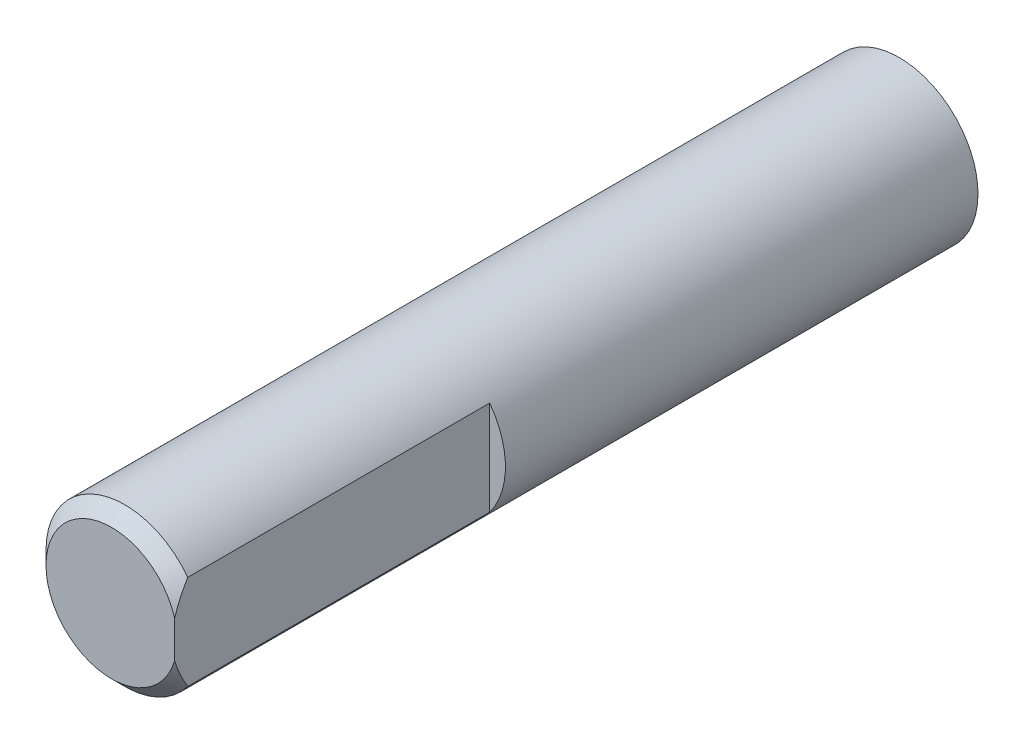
from build123d import *

# Parameters (mm, degrees)
ESQUISSE1_R             = 3
BOSS_EXTRU_1_DEPTH      = 30
CHANFREIN1_SIZE         = 0.5
ESQUISSE3_W             = 2
ESQUISSE3_H             = 5
ENL_V_MAT_EXTRU_1_DEPTH = 12


with BuildPart() as part:
    # Esquisse1 → Boss.-Extru.1 (new body)
    with BuildSketch(Plane.XY):
        Circle(ESQUISSE1_R)
    extrude(amount=BOSS_EXTRU_1_DEPTH)

    # Chanfrein1
    chanfrein1_edges = [part.edges().sort_by_distance(p)[0] for p in [
        (-3, 0, 30),
    ]]
    chamfer(chanfrein1_edges, length=CHANFREIN1_SIZE)

    # Esquisse3 → Enl_v. mat.-Extru.1 (cut)
    with BuildSketch(Plane.XY.offset(30)):
        with Locations((3.4, 0)):
            Rectangle(ESQUISSE3_W, ESQUISSE3_H)
    extrude(amount=-ENL_V_MAT_EXTRU_1_DEPTH, mode=Mode.SUBTRACT)


solid = part.part
